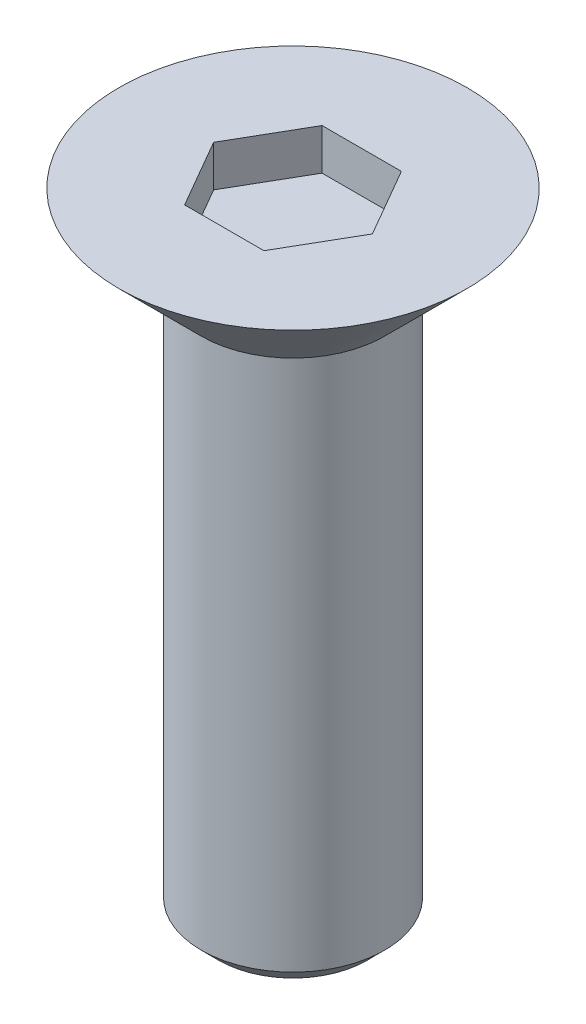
from build123d import *

# Parameters (mm, degrees)
SKETCH1_R           = 3.8
BASE_EXTRUDE_DEPTH  = 1.8
BASE_EXTRUDE_DRAFT  = -45
SKETCH2_R           = 2
BOSS_EXTRUDE1_DEPTH = 11.9888
CUT_EXTRUDE1_DEPTH  = 0.9
CHAMFER2_SIZE       = 0.381


with BuildPart() as part:
    # Sketch1 → Base-Extrude (with draft: the straight prism first)
    with BuildSketch(Plane(origin=(0, 0, 0), x_dir=(1, 0, 0), z_dir=(0, 1, 0))):
        Circle(SKETCH1_R)
    extrude(amount=-BASE_EXTRUDE_DEPTH)
    # Base-Extrude: the draft: its side faces are tilted about the plane it starts from
    base_extrude_sides = [part.faces().sort_by_distance(p)[0] for p in [
        (-3.8, -0.9, 0),
    ]]
    draft(base_extrude_sides, Plane(origin=(0, 0, 0), x_dir=(1, 0, 0), z_dir=(0, 1, 0)), BASE_EXTRUDE_DRAFT)

    # Sketch2 → Boss-Extrude1 (add)
    with BuildSketch(Plane.XZ.offset(1.8)):
        with Locations(Location((0, 0, 0), (0, 0, 90))):
            Circle(SKETCH2_R)
    extrude(amount=BOSS_EXTRUDE1_DEPTH)

    # Sketch3 → Cut-Extrude1 (cut)
    with BuildSketch(Plane(origin=(0, 0, 0), x_dir=(-1, 0, 0), z_dir=(0, 1, 0))):
        Polygon((-1.732050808, 0), (-0.866025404, -1.5), (0.866025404, -1.5), (1.732050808, 0), (0.866025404, 1.5), (-0.866025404, 1.5), align=None)
    extrude(amount=-CUT_EXTRUDE1_DEPTH, mode=Mode.SUBTRACT)

    # Chamfer2
    chamfer2_edges = [part.edges().sort_by_distance(p)[0] for p in [
        (0, -13.7888, -2),
    ]]
    chamfer(chamfer2_edges, length=CHAMFER2_SIZE)


solid = part.part
